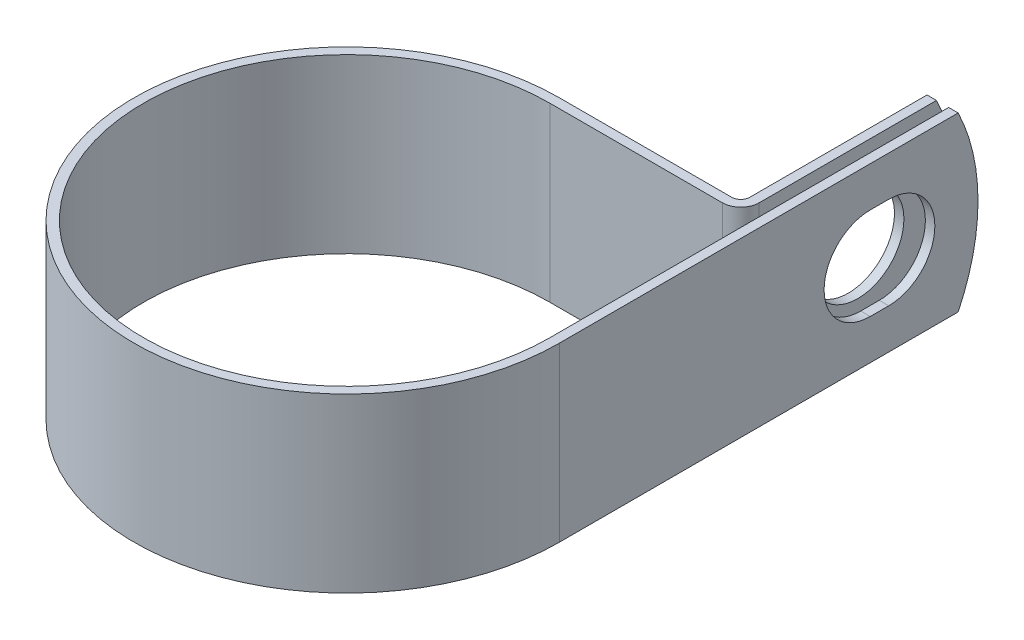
from build123d import *

# Parameters (mm, degrees)
EXTRUDE_THIN1_DEPTH = 11.1125
SKETCH2_R           = 5.9436
CUT_EXTRUDE1_DEPTH  = 1.2192
CUT_EXTRUDE2_REACH  = 79.726
CUT_EXTRUDE3_DEPTH  = 75.949504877


with BuildPart() as part:
    # Sketch1 → Extrude-Thin1 (new, symmetric)
    with BuildSketch(Plane(origin=(0, 0, 0), x_dir=(1, 0, 0), z_dir=(0, 1, 0))):
        with BuildLine():
            Line((26.1874, 53.975), (26.1874, 26.1874))
            Line((26.1874, 26.1874), (26.1874, 0))
            ThreePointArc((26.1874, 0), (-18.517288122, -18.517288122), (0, 26.1874))
            Line((0, 26.1874), (22.23516, 26.1874))
            ThreePointArc((22.23516, 26.1874), (23.916263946, 26.883736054), (24.6126, 28.56484))
            Line((24.6126, 28.56484), (24.6126, 53.975))
            Line((24.6126, 53.975), (23.3934, 53.975))
            Line((23.3934, 53.975), (23.3934, 28.56484))
            ThreePointArc((23.3934, 28.56484), (23.054159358, 27.745840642), (22.23516, 27.4066))
            Line((22.23516, 27.4066), (0, 27.4066))
            ThreePointArc((0, 27.4066), (-19.379392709, -19.379392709), (27.4066, 0))
            Line((27.4066, 0), (27.4066, 26.1874))
            Line((27.4066, 26.1874), (27.4066, 53.975))
            Line((27.4066, 53.975), (26.1874, 53.975))
        make_face()
    extrude(amount=EXTRUDE_THIN1_DEPTH, both=True)

    # Sketch2 → Cut-Extrude1 (cut)
    with BuildSketch(Plane.ZY.offset(-23.3934)):
        with Locations((-41.275, 0)):
            Circle(SKETCH2_R)
    extrude(amount=-CUT_EXTRUDE1_DEPTH, mode=Mode.SUBTRACT)

    # Sketch3 → Cut-Extrude2 (cut, up to next)
    with BuildSketch(Plane(origin=(27.4066, 0, 0), x_dir=(0, 0, -1), z_dir=(1, 0, 0)), mode=Mode.PRIVATE) as cut_extrude2_sk1:
        with BuildLine():
            Line((40.0812, 5.9436), (42.4688, 5.9436))
            ThreePointArc((42.4688, 5.9436), (48.4124, 0), (42.4688, -5.9436))
            Line((42.4688, -5.9436), (40.0812, -5.9436))
            ThreePointArc((40.0812, -5.9436), (34.1376, 0), (40.0812, 5.9436))
        make_face()
    cut_extrude2_tool1 = extrude(cut_extrude2_sk1.sketch, amount=-CUT_EXTRUDE2_REACH, mode=Mode.PRIVATE) & part.part
    add(cut_extrude2_tool1.solids().sort_by_distance((27.4066, 0, -41.275))[0], mode=Mode.SUBTRACT)

    # Sketch4 → Cut-Extrude3 (cut, through all)
    with BuildSketch(Plane.ZY.offset(-23.3934)):
        with BuildLine():
            Line((-51.41514763, 11.1125), (-53.975, 11.1125))
            Line((-53.975, 11.1125), (-53.975, 0))
            ThreePointArc((-53.975, 0), (-53.326765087, 5.701765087), (-51.41514763, 11.1125))
        make_face()
        with BuildLine():
            ThreePointArc((-51.41514763, -11.1125), (-53.326765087, -5.701765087), (-53.975, 0))
            Line((-53.975, 0), (-53.975, -11.1125))
            Line((-53.975, -11.1125), (-51.41514763, -11.1125))
        make_face()
    extrude(amount=-CUT_EXTRUDE3_DEPTH, mode=Mode.SUBTRACT)


solid = part.part
